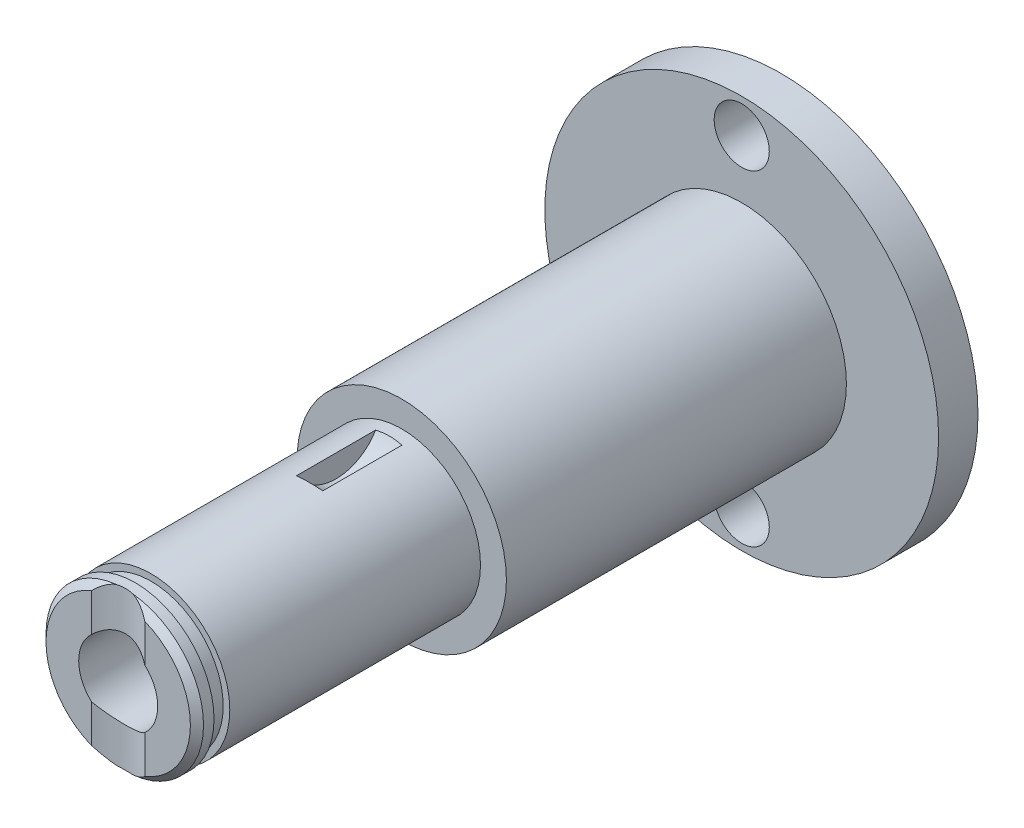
from build123d import *

# Parameters (mm, degrees)
ESQUISSE26_R                    = 15
BASE_EXTRUSION_DEPTH            = 3
ESQUISSE27_R                    = 7.975
BOSSAGE_EXTRUSION1_DEPTH        = 33.9
ESQUISSE29_R                    = 6
BOSSAGE_EXTRUSION2_DEPTH        = 13.6
CHANFREIN1_SIZE                 = 0.5
ENL_V_START                     = -8
ESQUISSE32_R                    = 7.975
ESQUISSE32_R_2                  = 6
ENL_V_MAT_EXTRUSION4_DEPTH      = 8
ESQUISSE30_R                    = 3.01
ENL_V_MAT_EXTRUSION2_DEPTH      = 55.77453788
ESQUISSE31_R                    = 3.5
ENL_V_MAT_EXTRUSION3_DEPTH      = 1
ENL_V_MAT_EXTRUSION5_DEPTH      = 53.021630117
ENL_V_MAT_EXTRUSION5_DEPTH_BACK = 53.021630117
ESQUISSE35_R                    = 4
ESQUISSE37_R                    = 2.1
ENL_V_MAT_EXTRUSION7_DEPTH      = 55.774537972
ENL_V_START_2                   = -1.2
ESQUISSE38_R                    = 6
ESQUISSE38_R_2                  = 5.5
ENL_V_MAT_EXTRUSION8_DEPTH      = 1.2


with BuildPart() as part:
    # Esquisse26 → Base-Extrusion (new body)
    with BuildSketch(Plane.XY):
        Circle(ESQUISSE26_R)
    extrude(amount=-BASE_EXTRUSION_DEPTH)

    # Esquisse27 → Bossage-Extrusion1 (add)
    with BuildSketch(Plane.XY):
        Circle(ESQUISSE27_R)
    extrude(amount=BOSSAGE_EXTRUSION1_DEPTH)

    # Esquisse29 → Bossage-Extrusion2 (add)
    with BuildSketch(Plane.XY.offset(33.9)):
        Circle(ESQUISSE29_R)
    extrude(amount=BOSSAGE_EXTRUSION2_DEPTH)

    # Chanfrein1
    chanfrein1_edges = [part.edges().sort_by_distance(p)[0] for p in [
        (-6, 0, 47.5),
    ]]
    chamfer(chanfrein1_edges, length=CHANFREIN1_SIZE)

    # Esquisse32 → Enl_v. mat.-Extrusion4 (cut)
    with BuildSketch(Plane.XY.offset(33.9).offset(ENL_V_START)):
        Circle(ESQUISSE32_R)
        Circle(ESQUISSE32_R_2, mode=Mode.SUBTRACT)
    extrude(amount=ENL_V_MAT_EXTRUSION4_DEPTH, mode=Mode.SUBTRACT)

    # Esquisse30 → Enl_v. mat.-Extrusion2 (cut, through all)
    with BuildSketch(Plane.XY.offset(47.5)):
        Circle(ESQUISSE30_R)
    extrude(amount=-ENL_V_MAT_EXTRUSION2_DEPTH, mode=Mode.SUBTRACT)

    # Esquisse31 → Enl_v. mat.-Extrusion3 (cut, symmetric)
    with BuildSketch(Plane(origin=(0, 0, 0), x_dir=(0, 0, -1), z_dir=(1, 0, 0))):
        with Locations((-29.9, 7.7)):
            Circle(ESQUISSE31_R)
    extrude(amount=ENL_V_MAT_EXTRUSION3_DEPTH, both=True, mode=Mode.SUBTRACT)

    # Esquisse35 → Enl_v. mat.-Extrusion5 (cut, two sides: drawn at the far end of the back side and taken through both)
    with BuildSketch(Plane(origin=(0, 0, 0), x_dir=(1, 0, 0), z_dir=(0, 1, 0)).offset(-ENL_V_MAT_EXTRUSION5_DEPTH_BACK)):
        with Locations((0, -50.95)):
            Circle(ESQUISSE35_R)
    extrude(amount=ENL_V_MAT_EXTRUSION5_DEPTH + ENL_V_MAT_EXTRUSION5_DEPTH_BACK, mode=Mode.SUBTRACT)

    # Esquisse37 → Enl_v. mat.-Extrusion7 (cut, through all)
    with BuildSketch(Plane(origin=(0, 0, -3), x_dir=(-1, 0, 0), z_dir=(0, 0, -1))):
        with Locations((0, -12.4)):
            Circle(ESQUISSE37_R)
        with Locations((0, 12.4)):
            Circle(ESQUISSE37_R)
    extrude(amount=-ENL_V_MAT_EXTRUSION7_DEPTH, mode=Mode.SUBTRACT)

    # Esquisse38 → Enl_v. mat.-Extrusion8 (cut)
    with BuildSketch(Plane.XY.offset(46.2).offset(ENL_V_START_2)):
        Circle(ESQUISSE38_R)
        Circle(ESQUISSE38_R_2, mode=Mode.SUBTRACT)
    extrude(amount=ENL_V_MAT_EXTRUSION8_DEPTH, mode=Mode.SUBTRACT)


solid = part.part
